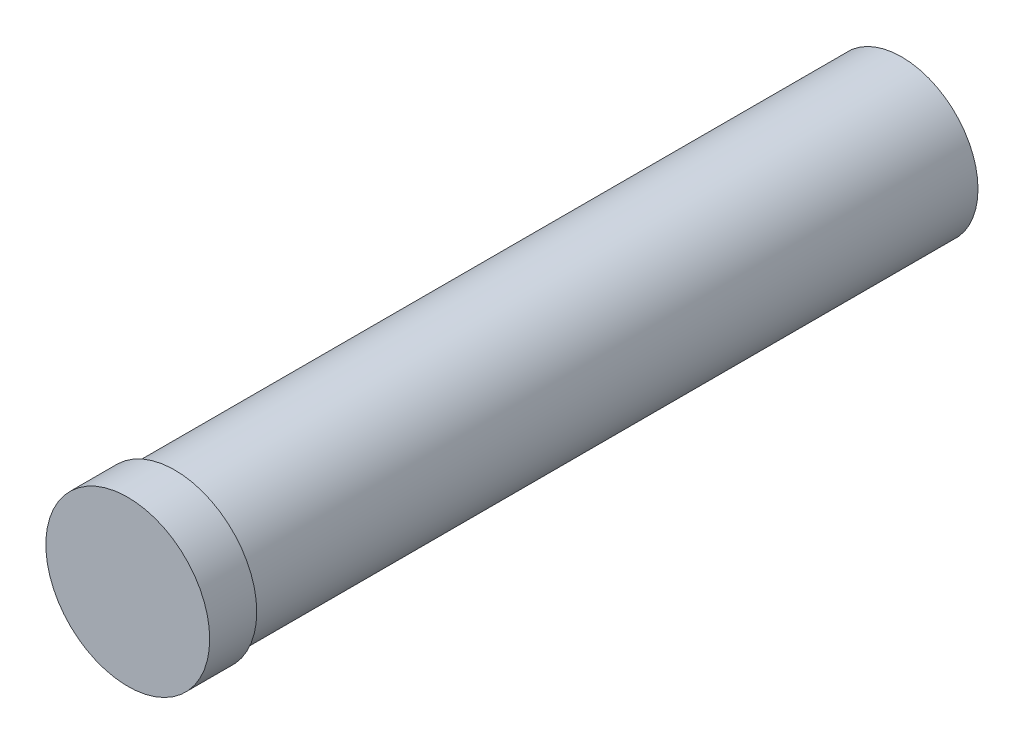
from build123d import *

# Parameters (mm, degrees)
ESQUISSE1_R      = 91.25
EXTRUSION1_DEPTH = 52.4
ESQUISSE2_R      = 85
EXTRUSION2_DEPTH = 809.6
CHANFREIN1_SIZE  = 2


with BuildPart() as part:
    # Esquisse1 → Extrusion1 (new body)
    with BuildSketch(Plane.XY):
        Circle(ESQUISSE1_R)
    extrude(amount=-EXTRUSION1_DEPTH)

    # Esquisse2 → Extrusion2 (add)
    with BuildSketch(Plane(origin=(0, 0, -52.4), x_dir=(-1, 0, 0), z_dir=(0, 0, -1))):
        with Locations(Location((0, 0, 0), (0, 0, 180))):
            Circle(ESQUISSE2_R)
    extrude(amount=EXTRUSION2_DEPTH)

    # Esquisse3 → Enl_vement de mati_re-R_volution1 (revolve, cut)
    with BuildSketch(Plane(origin=(0, 0, 0), x_dir=(0, 0, -1), z_dir=(1, 0, 0)), mode=Mode.PRIVATE) as enl_vement_de_mati_re_r_volution1_sk:
        Polygon((862, 0), (862, 77), (823, 77), (823, 74), (788, 74), (788, 70), (60, 70), (60, 0), align=None)
    revolve(enl_vement_de_mati_re_r_volution1_sk.sketch.rotate(Axis((0, 0, 0), (0, 0, -1)), 90), axis=Axis((0, 0, 0), (0, 0, -1)), mode=Mode.SUBTRACT)

    # Chanfrein1
    chanfrein1_edges = [part.edges().sort_by_distance(p)[0] for p in [
        (-77, 0, -862),
    ]]
    chamfer(chanfrein1_edges, length=CHANFREIN1_SIZE)


solid = part.part
